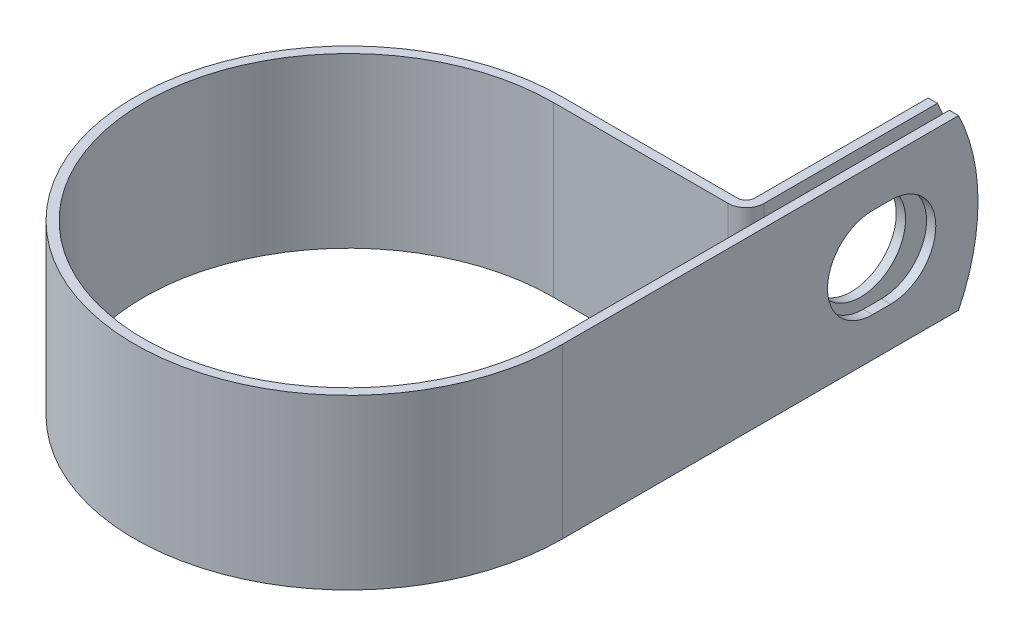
ISO-10303-21;
HEADER;
FILE_DESCRIPTION(('STEP AP214'),'2;1');
FILE_NAME('part.step','',(''),(''),'','','');
FILE_SCHEMA(('AUTOMOTIVE_DESIGN { 1 0 10303 214 1 1 1 1 }'));
ENDSEC;
DATA;
#1=APPLICATION_CONTEXT('core data for automotive mechanical design processes');
#2=APPLICATION_PROTOCOL_DEFINITION('international standard','automotive_design',2000,#1);
#3=PRODUCT_CONTEXT('',#1,'mechanical');
#4=PRODUCT('Part','Part','',(#3));
#5=PRODUCT_RELATED_PRODUCT_CATEGORY('part','',(#4));
#6=PRODUCT_DEFINITION_FORMATION('','',#4);
#7=PRODUCT_DEFINITION_CONTEXT('part definition',#1,'design');
#8=PRODUCT_DEFINITION('design','',#6,#7);
#9=PRODUCT_DEFINITION_SHAPE('','',#8);
#10=(LENGTH_UNIT() NAMED_UNIT(*) SI_UNIT(.MILLI.,.METRE.));
#11=(NAMED_UNIT(*) PLANE_ANGLE_UNIT() SI_UNIT($,.RADIAN.));
#12=(NAMED_UNIT(*) SI_UNIT($,.STERADIAN.) SOLID_ANGLE_UNIT());
#13=UNCERTAINTY_MEASURE_WITH_UNIT(LENGTH_MEASURE(1.E-05),#10,'distance_accuracy_value','');
#14=(GEOMETRIC_REPRESENTATION_CONTEXT(3) GLOBAL_UNCERTAINTY_ASSIGNED_CONTEXT((#13)) GLOBAL_UNIT_ASSIGNED_CONTEXT((#10,
#11,#12)) REPRESENTATION_CONTEXT('',''));
#15=CARTESIAN_POINT('',(0.,0.,0.));
#16=DIRECTION('',(0.,0.,1.));
#17=DIRECTION('',(1.,0.,0.));
#18=AXIS2_PLACEMENT_3D('',#15,#16,#17);
#19=CARTESIAN_POINT('',(26.9875,11.1125,0.));
#20=DIRECTION('',(-1.,0.,0.));
#21=DIRECTION('',(0.,0.,1.));
#22=AXIS2_PLACEMENT_3D('',#19,#20,#21);
#23=PLANE('',#22);
#24=DIRECTION('',(0.,0.,-1.));
#25=VECTOR('',#24,1.);
#26=CARTESIAN_POINT('',(26.9875,-5.9436,-40.8685999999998));
#27=LINE('',#26,#25);
#28=CARTESIAN_POINT('',(26.9875,-5.9436,-40.8685999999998));
#29=VERTEX_POINT('',#28);
#30=CARTESIAN_POINT('',(26.9875,-5.9436,-43.2562000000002));
#31=VERTEX_POINT('',#30);
#32=EDGE_CURVE('E218',#29,#31,#27,.T.);
#33=ORIENTED_EDGE('',*,*,#32,.T.);
#34=CARTESIAN_POINT('',(26.9875,0.,-43.2561999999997));
#35=DIRECTION('',(-1.,0.,0.));
#36=DIRECTION('',(0.,0.,1.));
#37=AXIS2_PLACEMENT_3D('',#34,#35,#36);
#38=CIRCLE('',#37,5.9436);
#39=CARTESIAN_POINT('',(26.9875,5.9436,-43.2562000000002));
#40=VERTEX_POINT('',#39);
#41=EDGE_CURVE('E239',#31,#40,#38,.F.);
#42=ORIENTED_EDGE('',*,*,#41,.T.);
#43=DIRECTION('',(0.,0.,1.));
#44=VECTOR('',#43,1.);
#45=CARTESIAN_POINT('',(26.9875,5.9436,-40.8685999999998));
#46=LINE('',#45,#44);
#47=CARTESIAN_POINT('',(26.9875,5.9436,-40.8685999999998));
#48=VERTEX_POINT('',#47);
#49=EDGE_CURVE('E235',#40,#48,#46,.T.);
#50=ORIENTED_EDGE('',*,*,#49,.T.);
#51=CARTESIAN_POINT('',(26.9875,0.,-40.8685999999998));
#52=DIRECTION('',(-1.,0.,0.));
#53=DIRECTION('',(0.,0.,1.));
#54=AXIS2_PLACEMENT_3D('',#51,#52,#53);
#55=CIRCLE('',#54,5.9436);
#56=EDGE_CURVE('E230',#48,#29,#55,.F.);
#57=ORIENTED_EDGE('',*,*,#56,.T.);
#58=EDGE_LOOP('',(#33,#42,#50,#57));
#59=FACE_BOUND('',#58,.T.);
#60=CARTESIAN_POINT('',(26.9875,0.,-29.3624));
#61=DIRECTION('',(-1.,0.,0.));
#62=DIRECTION('',(0.,0.,1.));
#63=AXIS2_PLACEMENT_3D('',#60,#61,#62);
#64=CIRCLE('',#63,25.4);
#65=CARTESIAN_POINT('',(26.9875,11.1125,-52.2025476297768));
#66=VERTEX_POINT('',#65);
#67=CARTESIAN_POINT('',(26.9875,-11.1125,-52.2025476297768));
#68=VERTEX_POINT('',#67);
#69=EDGE_CURVE('E57',#66,#68,#64,.T.);
#70=ORIENTED_EDGE('',*,*,#69,.T.);
#71=DIRECTION('',(0.,0.,-1.));
#72=VECTOR('',#71,1.);
#73=CARTESIAN_POINT('',(26.9875,-11.1125,0.));
#74=LINE('',#73,#72);
#75=CARTESIAN_POINT('',(26.9875,-11.1125,0.));
#76=VERTEX_POINT('',#75);
#77=EDGE_CURVE('E253',#76,#68,#74,.T.);
#78=ORIENTED_EDGE('',*,*,#77,.F.);
#79=DIRECTION('',(0.,-1.,0.));
#80=VECTOR('',#79,1.);
#81=CARTESIAN_POINT('',(26.9875,11.1125,0.));
#82=LINE('',#81,#80);
#83=CARTESIAN_POINT('',(26.9875,11.1125,0.));
#84=VERTEX_POINT('',#83);
#85=EDGE_CURVE('E200',#84,#76,#82,.T.);
#86=ORIENTED_EDGE('',*,*,#85,.F.);
#87=DIRECTION('',(0.,0.,-1.));
#88=VECTOR('',#87,1.);
#89=CARTESIAN_POINT('',(26.9875,11.1125,-26.9875));
#90=LINE('',#89,#88);
#91=EDGE_CURVE('E255',#84,#66,#90,.T.);
#92=ORIENTED_EDGE('',*,*,#91,.T.);
#93=EDGE_LOOP('',(#70,#78,#86,#92));
#94=FACE_BOUND('',#93,.T.);
#95=ADVANCED_FACE('F36',(#59,#94),#23,.T.);
#96=CARTESIAN_POINT('',(25.4127,11.1125,-54.7624));
#97=DIRECTION('',(1.,0.,0.));
#98=DIRECTION('',(0.,0.,-1.));
#99=AXIS2_PLACEMENT_3D('',#96,#97,#98);
#100=PLANE('',#99);
#101=CARTESIAN_POINT('',(25.4127,0.,-42.0624));
#102=DIRECTION('',(1.,0.,0.));
#103=DIRECTION('',(0.,0.,-1.));
#104=AXIS2_PLACEMENT_3D('',#101,#102,#103);
#105=CIRCLE('',#104,5.9436);
#106=CARTESIAN_POINT('',(25.4127,0.,-48.006));
#107=VERTEX_POINT('',#106);
#108=EDGE_CURVE('E250',#107,#107,#105,.F.);
#109=ORIENTED_EDGE('',*,*,#108,.T.);
#110=EDGE_LOOP('',(#109));
#111=FACE_BOUND('',#110,.T.);
#112=DIRECTION('',(0.,0.,1.));
#113=VECTOR('',#112,1.);
#114=CARTESIAN_POINT('',(25.4127,-11.1125,-54.7624));
#115=LINE('',#114,#113);
#116=CARTESIAN_POINT('',(25.4127,-11.1125,-52.2025476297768));
#117=VERTEX_POINT('',#116);
#118=CARTESIAN_POINT('',(25.4127,-11.1125,-29.36494));
#119=VERTEX_POINT('',#118);
#120=EDGE_CURVE('E166',#117,#119,#115,.T.);
#121=ORIENTED_EDGE('',*,*,#120,.F.);
#122=CARTESIAN_POINT('',(25.4127,0.,-29.3624));
#123=DIRECTION('',(1.,0.,0.));
#124=DIRECTION('',(0.,0.,-1.));
#125=AXIS2_PLACEMENT_3D('',#122,#123,#124);
#126=CIRCLE('',#125,25.4);
#127=CARTESIAN_POINT('',(25.4127,11.1125,-52.2025476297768));
#128=VERTEX_POINT('',#127);
#129=EDGE_CURVE('E158',#117,#128,#126,.T.);
#130=ORIENTED_EDGE('',*,*,#129,.T.);
#131=DIRECTION('',(0.,0.,1.));
#132=VECTOR('',#131,1.);
#133=CARTESIAN_POINT('',(25.4127,11.1125,-54.7624));
#134=LINE('',#133,#132);
#135=CARTESIAN_POINT('',(25.4127,11.1125,-29.36494));
#136=VERTEX_POINT('',#135);
#137=EDGE_CURVE('E206',#128,#136,#134,.T.);
#138=ORIENTED_EDGE('',*,*,#137,.T.);
#139=DIRECTION('',(0.,-1.,0.));
#140=VECTOR('',#139,1.);
#141=CARTESIAN_POINT('',(25.4127,11.1125,-29.36494));
#142=LINE('',#141,#140);
#143=EDGE_CURVE('E193',#136,#119,#142,.T.);
#144=ORIENTED_EDGE('',*,*,#143,.T.);
#145=EDGE_LOOP('',(#121,#130,#138,#144));
#146=FACE_BOUND('',#145,.T.);
#147=ADVANCED_FACE('F208',(#111,#146),#100,.T.);
#148=CARTESIAN_POINT('',(24.1935,11.1125,-54.7624));
#149=DIRECTION('',(1.,0.,0.));
#150=DIRECTION('',(0.,0.,-1.));
#151=AXIS2_PLACEMENT_3D('',#148,#149,#150);
#152=PLANE('',#151);
#153=CARTESIAN_POINT('',(24.1935,0.,-42.0624));
#154=DIRECTION('',(-1.,0.,0.));
#155=DIRECTION('',(0.,0.,1.));
#156=AXIS2_PLACEMENT_3D('',#153,#154,#155);
#157=CIRCLE('',#156,5.9436);
#158=CARTESIAN_POINT('',(24.1935,0.,-36.1188));
#159=VERTEX_POINT('',#158);
#160=EDGE_CURVE('E247',#159,#159,#157,.T.);
#161=ORIENTED_EDGE('',*,*,#160,.F.);
#162=EDGE_LOOP('',(#161));
#163=FACE_BOUND('',#162,.T.);
#164=CARTESIAN_POINT('',(24.1935,0.,-29.3624));
#165=DIRECTION('',(-1.,0.,0.));
#166=DIRECTION('',(0.,0.,1.));
#167=AXIS2_PLACEMENT_3D('',#164,#165,#166);
#168=CIRCLE('',#167,25.4);
#169=CARTESIAN_POINT('',(24.1935,11.1125,-52.2025476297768));
#170=VERTEX_POINT('',#169);
#171=CARTESIAN_POINT('',(24.1935,-11.1125,-52.2025476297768));
#172=VERTEX_POINT('',#171);
#173=EDGE_CURVE('E49',#170,#172,#168,.T.);
#174=ORIENTED_EDGE('',*,*,#173,.T.);
#175=DIRECTION('',(0.,0.,1.));
#176=VECTOR('',#175,1.);
#177=CARTESIAN_POINT('',(24.1935,-11.1125,-54.7624));
#178=LINE('',#177,#176);
#179=CARTESIAN_POINT('',(24.1935,-11.1125,-29.36494));
#180=VERTEX_POINT('',#179);
#181=EDGE_CURVE('E149',#172,#180,#178,.T.);
#182=ORIENTED_EDGE('',*,*,#181,.T.);
#183=DIRECTION('',(0.,-1.,0.));
#184=VECTOR('',#183,1.);
#185=CARTESIAN_POINT('',(24.1935,11.1125,-29.36494));
#186=LINE('',#185,#184);
#187=CARTESIAN_POINT('',(24.1935,11.1125,-29.36494));
#188=VERTEX_POINT('',#187);
#189=EDGE_CURVE('E191',#188,#180,#186,.T.);
#190=ORIENTED_EDGE('',*,*,#189,.F.);
#191=DIRECTION('',(0.,0.,1.));
#192=VECTOR('',#191,1.);
#193=CARTESIAN_POINT('',(24.1935,11.1125,-54.7624));
#194=LINE('',#193,#192);
#195=EDGE_CURVE('E151',#170,#188,#194,.T.);
#196=ORIENTED_EDGE('',*,*,#195,.F.);
#197=EDGE_LOOP('',(#174,#182,#190,#196));
#198=FACE_BOUND('',#197,.T.);
#199=ADVANCED_FACE('F146',(#163,#198),#152,.F.);
#200=CARTESIAN_POINT('',(28.2067,11.1125,0.));
#201=DIRECTION('',(-1.,0.,0.));
#202=DIRECTION('',(0.,0.,1.));
#203=AXIS2_PLACEMENT_3D('',#200,#201,#202);
#204=PLANE('',#203);
#205=CARTESIAN_POINT('',(28.2067,0.,-43.2561999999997));
#206=DIRECTION('',(1.,0.,0.));
#207=DIRECTION('',(0.,0.,-1.));
#208=AXIS2_PLACEMENT_3D('',#205,#206,#207);
#209=CIRCLE('',#208,5.9436);
#210=CARTESIAN_POINT('',(28.2067,-5.9436,-43.2562000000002));
#211=VERTEX_POINT('',#210);
#212=CARTESIAN_POINT('',(28.2067,5.9436,-43.2562000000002));
#213=VERTEX_POINT('',#212);
#214=EDGE_CURVE('E219',#211,#213,#209,.T.);
#215=ORIENTED_EDGE('',*,*,#214,.F.);
#216=DIRECTION('',(0.,0.,-1.));
#217=VECTOR('',#216,1.);
#218=CARTESIAN_POINT('',(28.2067,-5.9436,-40.8685999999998));
#219=LINE('',#218,#217);
#220=CARTESIAN_POINT('',(28.2067,-5.9436,-40.8685999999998));
#221=VERTEX_POINT('',#220);
#222=EDGE_CURVE('E222',#221,#211,#219,.T.);
#223=ORIENTED_EDGE('',*,*,#222,.F.);
#224=CARTESIAN_POINT('',(28.2067,0.,-40.8685999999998));
#225=DIRECTION('',(1.,0.,0.));
#226=DIRECTION('',(0.,0.,-1.));
#227=AXIS2_PLACEMENT_3D('',#224,#225,#226);
#228=CIRCLE('',#227,5.9436);
#229=CARTESIAN_POINT('',(28.2067,5.9436,-40.8685999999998));
#230=VERTEX_POINT('',#229);
#231=EDGE_CURVE('E212',#230,#221,#228,.T.);
#232=ORIENTED_EDGE('',*,*,#231,.F.);
#233=DIRECTION('',(0.,0.,1.));
#234=VECTOR('',#233,1.);
#235=CARTESIAN_POINT('',(28.2067,5.9436,-40.8685999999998));
#236=LINE('',#235,#234);
#237=EDGE_CURVE('E216',#213,#230,#236,.T.);
#238=ORIENTED_EDGE('',*,*,#237,.F.);
#239=EDGE_LOOP('',(#215,#223,#232,#238));
#240=FACE_BOUND('',#239,.T.);
#241=DIRECTION('',(0.,0.,-1.));
#242=VECTOR('',#241,1.);
#243=CARTESIAN_POINT('',(28.2067,-11.1125,0.));
#244=LINE('',#243,#242);
#245=CARTESIAN_POINT('',(28.2067,-11.1125,0.));
#246=VERTEX_POINT('',#245);
#247=CARTESIAN_POINT('',(28.2067,-11.1125,-52.2025476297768));
#248=VERTEX_POINT('',#247);
#249=EDGE_CURVE('E177',#246,#248,#244,.T.);
#250=ORIENTED_EDGE('',*,*,#249,.T.);
#251=CARTESIAN_POINT('',(28.2067,0.,-29.3624));
#252=DIRECTION('',(-1.,0.,0.));
#253=DIRECTION('',(0.,0.,1.));
#254=AXIS2_PLACEMENT_3D('',#251,#252,#253);
#255=CIRCLE('',#254,25.4);
#256=CARTESIAN_POINT('',(28.2067,11.1125,-52.2025476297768));
#257=VERTEX_POINT('',#256);
#258=EDGE_CURVE('E152',#257,#248,#255,.T.);
#259=ORIENTED_EDGE('',*,*,#258,.F.);
#260=DIRECTION('',(0.,0.,-1.));
#261=VECTOR('',#260,1.);
#262=CARTESIAN_POINT('',(28.2067,11.1125,-26.9875));
#263=LINE('',#262,#261);
#264=CARTESIAN_POINT('',(28.2067,11.1125,0.));
#265=VERTEX_POINT('',#264);
#266=EDGE_CURVE('E180',#265,#257,#263,.T.);
#267=ORIENTED_EDGE('',*,*,#266,.F.);
#268=DIRECTION('',(0.,-1.,0.));
#269=VECTOR('',#268,1.);
#270=CARTESIAN_POINT('',(28.2067,11.1125,0.));
#271=LINE('',#270,#269);
#272=EDGE_CURVE('E181',#265,#246,#271,.T.);
#273=ORIENTED_EDGE('',*,*,#272,.T.);
#274=EDGE_LOOP('',(#250,#259,#267,#273));
#275=FACE_BOUND('',#274,.T.);
#276=ADVANCED_FACE('F303',(#240,#275),#204,.F.);
#277=CARTESIAN_POINT('',(0.,-11.1125,0.));
#278=DIRECTION('',(0.,1.,0.));
#279=DIRECTION('',(1.,0.,0.));
#280=AXIS2_PLACEMENT_3D('',#277,#278,#279);
#281=PLANE('',#280);
#282=DIRECTION('',(-1.,0.,0.));
#283=VECTOR('',#282,1.);
#284=CARTESIAN_POINT('',(28.2067,-11.1125,-52.2025476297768));
#285=LINE('',#284,#283);
#286=EDGE_CURVE('E153',#248,#68,#285,.T.);
#287=ORIENTED_EDGE('',*,*,#286,.F.);
#288=ORIENTED_EDGE('',*,*,#249,.F.);
#289=CARTESIAN_POINT('',(0.,-11.1125,0.));
#290=DIRECTION('',(0.,1.,0.));
#291=DIRECTION('',(1.,0.,0.));
#292=AXIS2_PLACEMENT_3D('',#289,#290,#291);
#293=CIRCLE('',#292,28.2067);
#294=CARTESIAN_POINT('',(0.,-11.1125,-28.2067));
#295=VERTEX_POINT('',#294);
#296=EDGE_CURVE('E175',#295,#246,#293,.T.);
#297=ORIENTED_EDGE('',*,*,#296,.F.);
#298=DIRECTION('',(1.,0.,0.));
#299=VECTOR('',#298,1.);
#300=CARTESIAN_POINT('',(0.,-11.1125,-28.2067));
#301=LINE('',#300,#299);
#302=CARTESIAN_POINT('',(23.03526,-11.1125,-28.2067));
#303=VERTEX_POINT('',#302);
#304=EDGE_CURVE('E168',#303,#295,#301,.F.);
#305=ORIENTED_EDGE('',*,*,#304,.F.);
#306=CARTESIAN_POINT('',(23.03526,-11.1125,-29.36494));
#307=DIRECTION('',(0.,1.,0.));
#308=DIRECTION('',(1.,0.,0.));
#309=AXIS2_PLACEMENT_3D('',#306,#307,#308);
#310=CIRCLE('',#309,1.15824);
#311=EDGE_CURVE('E165',#180,#303,#310,.F.);
#312=ORIENTED_EDGE('',*,*,#311,.F.);
#313=ORIENTED_EDGE('',*,*,#181,.F.);
#314=DIRECTION('',(-1.,0.,0.));
#315=VECTOR('',#314,1.);
#316=CARTESIAN_POINT('',(28.2067,-11.1125,-52.2025476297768));
#317=LINE('',#316,#315);
#318=EDGE_CURVE('E11',#117,#172,#317,.T.);
#319=ORIENTED_EDGE('',*,*,#318,.F.);
#320=ORIENTED_EDGE('',*,*,#120,.T.);
#321=CARTESIAN_POINT('',(23.03526,-11.1125,-29.36494));
#322=DIRECTION('',(0.,-1.,0.));
#323=DIRECTION('',(0.,0.,1.));
#324=AXIS2_PLACEMENT_3D('',#321,#322,#323);
#325=CIRCLE('',#324,2.37744);
#326=CARTESIAN_POINT('',(23.03526,-11.1125,-26.9875));
#327=VERTEX_POINT('',#326);
#328=EDGE_CURVE('E170',#119,#327,#325,.T.);
#329=ORIENTED_EDGE('',*,*,#328,.T.);
#330=DIRECTION('',(-1.,0.,0.));
#331=VECTOR('',#330,1.);
#332=CARTESIAN_POINT('',(0.,-11.1125,-26.9875));
#333=LINE('',#332,#331);
#334=CARTESIAN_POINT('',(0.,-11.1125,-26.9875));
#335=VERTEX_POINT('',#334);
#336=EDGE_CURVE('E280',#327,#335,#333,.T.);
#337=ORIENTED_EDGE('',*,*,#336,.T.);
#338=CARTESIAN_POINT('',(0.,-11.1125,0.));
#339=DIRECTION('',(0.,1.,0.));
#340=DIRECTION('',(0.,0.,1.));
#341=AXIS2_PLACEMENT_3D('',#338,#339,#340);
#342=CIRCLE('',#341,26.9875);
#343=EDGE_CURVE('E277',#335,#76,#342,.T.);
#344=ORIENTED_EDGE('',*,*,#343,.T.);
#345=ORIENTED_EDGE('',*,*,#77,.T.);
#346=EDGE_LOOP('',(#287,#288,#297,#305,#312,#313,#319,#320,#329,#337,#344,#345));
#347=FACE_BOUND('',#346,.T.);
#348=ADVANCED_FACE('F163',(#347),#281,.F.);
#349=CARTESIAN_POINT('',(0.,11.1125,0.));
#350=DIRECTION('',(0.,1.,0.));
#351=DIRECTION('',(1.,0.,0.));
#352=AXIS2_PLACEMENT_3D('',#349,#350,#351);
#353=PLANE('',#352);
#354=ORIENTED_EDGE('',*,*,#266,.T.);
#355=DIRECTION('',(-1.,0.,0.));
#356=VECTOR('',#355,1.);
#357=CARTESIAN_POINT('',(28.2067,11.1125,-52.2025476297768));
#358=LINE('',#357,#356);
#359=EDGE_CURVE('E210',#257,#66,#358,.T.);
#360=ORIENTED_EDGE('',*,*,#359,.T.);
#361=ORIENTED_EDGE('',*,*,#91,.F.);
#362=CARTESIAN_POINT('',(0.,11.1125,0.));
#363=DIRECTION('',(0.,1.,0.));
#364=DIRECTION('',(0.,0.,1.));
#365=AXIS2_PLACEMENT_3D('',#362,#363,#364);
#366=CIRCLE('',#365,26.9875);
#367=CARTESIAN_POINT('',(0.,11.1125,-26.9875));
#368=VERTEX_POINT('',#367);
#369=EDGE_CURVE('E258',#368,#84,#366,.T.);
#370=ORIENTED_EDGE('',*,*,#369,.F.);
#371=DIRECTION('',(-1.,0.,0.));
#372=VECTOR('',#371,1.);
#373=CARTESIAN_POINT('',(0.,11.1125,-26.9875));
#374=LINE('',#373,#372);
#375=CARTESIAN_POINT('',(23.03526,11.1125,-26.9875));
#376=VERTEX_POINT('',#375);
#377=EDGE_CURVE('E261',#376,#368,#374,.T.);
#378=ORIENTED_EDGE('',*,*,#377,.F.);
#379=CARTESIAN_POINT('',(23.03526,11.1125,-29.36494));
#380=DIRECTION('',(0.,-1.,0.));
#381=DIRECTION('',(0.,0.,1.));
#382=AXIS2_PLACEMENT_3D('',#379,#380,#381);
#383=CIRCLE('',#382,2.37744);
#384=EDGE_CURVE('E264',#136,#376,#383,.T.);
#385=ORIENTED_EDGE('',*,*,#384,.F.);
#386=ORIENTED_EDGE('',*,*,#137,.F.);
#387=DIRECTION('',(-1.,0.,0.));
#388=VECTOR('',#387,1.);
#389=CARTESIAN_POINT('',(28.2067,11.1125,-52.2025476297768));
#390=LINE('',#389,#388);
#391=EDGE_CURVE('E43',#128,#170,#390,.T.);
#392=ORIENTED_EDGE('',*,*,#391,.T.);
#393=ORIENTED_EDGE('',*,*,#195,.T.);
#394=CARTESIAN_POINT('',(23.03526,11.1125,-29.36494));
#395=DIRECTION('',(0.,1.,0.));
#396=DIRECTION('',(1.,0.,0.));
#397=AXIS2_PLACEMENT_3D('',#394,#395,#396);
#398=CIRCLE('',#397,1.15824);
#399=CARTESIAN_POINT('',(23.03526,11.1125,-28.2067));
#400=VERTEX_POINT('',#399);
#401=EDGE_CURVE('E269',#188,#400,#398,.F.);
#402=ORIENTED_EDGE('',*,*,#401,.T.);
#403=DIRECTION('',(1.,0.,0.));
#404=VECTOR('',#403,1.);
#405=CARTESIAN_POINT('',(0.,11.1125,-28.2067));
#406=LINE('',#405,#404);
#407=CARTESIAN_POINT('',(0.,11.1125,-28.2067));
#408=VERTEX_POINT('',#407);
#409=EDGE_CURVE('E271',#400,#408,#406,.F.);
#410=ORIENTED_EDGE('',*,*,#409,.T.);
#411=CARTESIAN_POINT('',(0.,11.1125,0.));
#412=DIRECTION('',(0.,1.,0.));
#413=DIRECTION('',(1.,0.,0.));
#414=AXIS2_PLACEMENT_3D('',#411,#412,#413);
#415=CIRCLE('',#414,28.2067);
#416=EDGE_CURVE('E185',#408,#265,#415,.T.);
#417=ORIENTED_EDGE('',*,*,#416,.T.);
#418=EDGE_LOOP('',(#354,#360,#361,#370,#378,#385,#386,#392,#393,#402,#410,#417));
#419=FACE_BOUND('',#418,.T.);
#420=ADVANCED_FACE('F204',(#419),#353,.T.);
#421=CARTESIAN_POINT('',(0.,11.1125,0.));
#422=DIRECTION('',(0.,-1.,0.));
#423=DIRECTION('',(0.,0.,-1.));
#424=AXIS2_PLACEMENT_3D('',#421,#422,#423);
#425=CYLINDRICAL_SURFACE('',#424,26.9875);
#426=ORIENTED_EDGE('',*,*,#343,.F.);
#427=DIRECTION('',(0.,-1.,0.));
#428=VECTOR('',#427,1.);
#429=CARTESIAN_POINT('',(0.,11.1125,-26.9875));
#430=LINE('',#429,#428);
#431=EDGE_CURVE('E198',#368,#335,#430,.T.);
#432=ORIENTED_EDGE('',*,*,#431,.F.);
#433=ORIENTED_EDGE('',*,*,#369,.T.);
#434=ORIENTED_EDGE('',*,*,#85,.T.);
#435=EDGE_LOOP('',(#426,#432,#433,#434));
#436=FACE_BOUND('',#435,.T.);
#437=ADVANCED_FACE('F293',(#436),#425,.F.);
#438=CARTESIAN_POINT('',(0.,11.1125,-26.9875));
#439=DIRECTION('',(0.,0.,1.));
#440=DIRECTION('',(1.,0.,0.));
#441=AXIS2_PLACEMENT_3D('',#438,#439,#440);
#442=PLANE('',#441);
#443=ORIENTED_EDGE('',*,*,#336,.F.);
#444=DIRECTION('',(0.,-1.,0.));
#445=VECTOR('',#444,1.);
#446=CARTESIAN_POINT('',(23.03526,11.1125,-26.9875));
#447=LINE('',#446,#445);
#448=EDGE_CURVE('E196',#376,#327,#447,.T.);
#449=ORIENTED_EDGE('',*,*,#448,.F.);
#450=ORIENTED_EDGE('',*,*,#377,.T.);
#451=ORIENTED_EDGE('',*,*,#431,.T.);
#452=EDGE_LOOP('',(#443,#449,#450,#451));
#453=FACE_BOUND('',#452,.T.);
#454=ADVANCED_FACE('F289',(#453),#442,.T.);
#455=CARTESIAN_POINT('',(23.03526,11.1125,-29.36494));
#456=DIRECTION('',(0.,-1.,0.));
#457=DIRECTION('',(0.,0.,-1.));
#458=AXIS2_PLACEMENT_3D('',#455,#456,#457);
#459=CYLINDRICAL_SURFACE('',#458,2.37744);
#460=ORIENTED_EDGE('',*,*,#328,.F.);
#461=ORIENTED_EDGE('',*,*,#143,.F.);
#462=ORIENTED_EDGE('',*,*,#384,.T.);
#463=ORIENTED_EDGE('',*,*,#448,.T.);
#464=EDGE_LOOP('',(#460,#461,#462,#463));
#465=FACE_BOUND('',#464,.T.);
#466=ADVANCED_FACE('F286',(#465),#459,.T.);
#467=CARTESIAN_POINT('',(23.03526,11.1125,-29.36494));
#468=DIRECTION('',(0.,-1.,0.));
#469=DIRECTION('',(0.,0.,-1.));
#470=AXIS2_PLACEMENT_3D('',#467,#468,#469);
#471=CYLINDRICAL_SURFACE('',#470,1.15824);
#472=ORIENTED_EDGE('',*,*,#311,.T.);
#473=DIRECTION('',(0.,-1.,0.));
#474=VECTOR('',#473,1.);
#475=CARTESIAN_POINT('',(23.03526,11.1125,-28.2067));
#476=LINE('',#475,#474);
#477=EDGE_CURVE('E188',#400,#303,#476,.T.);
#478=ORIENTED_EDGE('',*,*,#477,.F.);
#479=ORIENTED_EDGE('',*,*,#401,.F.);
#480=ORIENTED_EDGE('',*,*,#189,.T.);
#481=EDGE_LOOP('',(#472,#478,#479,#480));
#482=FACE_BOUND('',#481,.T.);
#483=ADVANCED_FACE('F316',(#482),#471,.F.);
#484=CARTESIAN_POINT('',(0.,11.1125,-28.2067));
#485=DIRECTION('',(0.,0.,1.));
#486=DIRECTION('',(1.,0.,0.));
#487=AXIS2_PLACEMENT_3D('',#484,#485,#486);
#488=PLANE('',#487);
#489=ORIENTED_EDGE('',*,*,#304,.T.);
#490=DIRECTION('',(0.,-1.,0.));
#491=VECTOR('',#490,1.);
#492=CARTESIAN_POINT('',(0.,11.1125,-28.2067));
#493=LINE('',#492,#491);
#494=EDGE_CURVE('E184',#408,#295,#493,.T.);
#495=ORIENTED_EDGE('',*,*,#494,.F.);
#496=ORIENTED_EDGE('',*,*,#409,.F.);
#497=ORIENTED_EDGE('',*,*,#477,.T.);
#498=EDGE_LOOP('',(#489,#495,#496,#497));
#499=FACE_BOUND('',#498,.T.);
#500=ADVANCED_FACE('F312',(#499),#488,.F.);
#501=CARTESIAN_POINT('',(0.,11.1125,0.));
#502=DIRECTION('',(0.,-1.,0.));
#503=DIRECTION('',(0.,0.,-1.));
#504=AXIS2_PLACEMENT_3D('',#501,#502,#503);
#505=CYLINDRICAL_SURFACE('',#504,28.2067);
#506=ORIENTED_EDGE('',*,*,#296,.T.);
#507=ORIENTED_EDGE('',*,*,#272,.F.);
#508=ORIENTED_EDGE('',*,*,#416,.F.);
#509=ORIENTED_EDGE('',*,*,#494,.T.);
#510=EDGE_LOOP('',(#506,#507,#508,#509));
#511=FACE_BOUND('',#510,.T.);
#512=ADVANCED_FACE('F309',(#511),#505,.T.);
#513=CARTESIAN_POINT('',(42.2237394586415,0.,-42.0624));
#514=DIRECTION('',(-1.,0.,0.));
#515=DIRECTION('',(0.,0.,1.));
#516=AXIS2_PLACEMENT_3D('',#513,#514,#515);
#517=CYLINDRICAL_SURFACE('',#516,5.9436);
#518=ORIENTED_EDGE('',*,*,#160,.T.);
#519=EDGE_LOOP('',(#518));
#520=FACE_BOUND('',#519,.T.);
#521=ORIENTED_EDGE('',*,*,#108,.F.);
#522=EDGE_LOOP('',(#521));
#523=FACE_BOUND('',#522,.T.);
#524=ADVANCED_FACE('F361',(#520,#523),#517,.F.);
#525=CARTESIAN_POINT('',(8.41129374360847,-5.9436,-40.8685999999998));
#526=DIRECTION('',(0.,-1.,0.));
#527=DIRECTION('',(0.,0.,-1.));
#528=AXIS2_PLACEMENT_3D('',#525,#526,#527);
#529=PLANE('',#528);
#530=DIRECTION('',(1.,0.,0.));
#531=VECTOR('',#530,1.);
#532=CARTESIAN_POINT('',(8.41129374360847,-5.9436,-40.8685999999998));
#533=LINE('',#532,#531);
#534=EDGE_CURVE('E233',#29,#221,#533,.T.);
#535=ORIENTED_EDGE('',*,*,#534,.T.);
#536=ORIENTED_EDGE('',*,*,#222,.T.);
#537=DIRECTION('',(1.,0.,0.));
#538=VECTOR('',#537,1.);
#539=CARTESIAN_POINT('',(8.41129374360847,-5.9436,-43.2562000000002));
#540=LINE('',#539,#538);
#541=EDGE_CURVE('E229',#31,#211,#540,.T.);
#542=ORIENTED_EDGE('',*,*,#541,.F.);
#543=ORIENTED_EDGE('',*,*,#32,.F.);
#544=EDGE_LOOP('',(#535,#536,#542,#543));
#545=FACE_BOUND('',#544,.T.);
#546=ADVANCED_FACE('F336',(#545),#529,.F.);
#547=CARTESIAN_POINT('',(8.41129374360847,0.,-43.2561999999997));
#548=DIRECTION('',(1.,0.,0.));
#549=DIRECTION('',(0.,0.,-1.));
#550=AXIS2_PLACEMENT_3D('',#547,#548,#549);
#551=CYLINDRICAL_SURFACE('',#550,5.9436);
#552=ORIENTED_EDGE('',*,*,#541,.T.);
#553=ORIENTED_EDGE('',*,*,#214,.T.);
#554=DIRECTION('',(1.,0.,0.));
#555=VECTOR('',#554,1.);
#556=CARTESIAN_POINT('',(8.41129374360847,5.9436,-43.2562000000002));
#557=LINE('',#556,#555);
#558=EDGE_CURVE('E238',#40,#213,#557,.T.);
#559=ORIENTED_EDGE('',*,*,#558,.F.);
#560=ORIENTED_EDGE('',*,*,#41,.F.);
#561=EDGE_LOOP('',(#552,#553,#559,#560));
#562=FACE_BOUND('',#561,.T.);
#563=ADVANCED_FACE('F340',(#562),#551,.F.);
#564=CARTESIAN_POINT('',(8.41129374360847,5.9436,-40.8685999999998));
#565=DIRECTION('',(0.,1.,0.));
#566=DIRECTION('',(0.,0.,1.));
#567=AXIS2_PLACEMENT_3D('',#564,#565,#566);
#568=PLANE('',#567);
#569=ORIENTED_EDGE('',*,*,#558,.T.);
#570=ORIENTED_EDGE('',*,*,#237,.T.);
#571=DIRECTION('',(1.,0.,0.));
#572=VECTOR('',#571,1.);
#573=CARTESIAN_POINT('',(8.41129374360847,5.9436,-40.8685999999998));
#574=LINE('',#573,#572);
#575=EDGE_CURVE('E234',#48,#230,#574,.T.);
#576=ORIENTED_EDGE('',*,*,#575,.F.);
#577=ORIENTED_EDGE('',*,*,#49,.F.);
#578=EDGE_LOOP('',(#569,#570,#576,#577));
#579=FACE_BOUND('',#578,.T.);
#580=ADVANCED_FACE('F344',(#579),#568,.F.);
#581=CARTESIAN_POINT('',(8.41129374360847,0.,-40.8685999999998));
#582=DIRECTION('',(1.,0.,0.));
#583=DIRECTION('',(0.,0.,-1.));
#584=AXIS2_PLACEMENT_3D('',#581,#582,#583);
#585=CYLINDRICAL_SURFACE('',#584,5.9436);
#586=ORIENTED_EDGE('',*,*,#575,.T.);
#587=ORIENTED_EDGE('',*,*,#231,.T.);
#588=ORIENTED_EDGE('',*,*,#534,.F.);
#589=ORIENTED_EDGE('',*,*,#56,.F.);
#590=EDGE_LOOP('',(#586,#587,#588,#589));
#591=FACE_BOUND('',#590,.T.);
#592=ADVANCED_FACE('F348',(#591),#585,.F.);
#593=CARTESIAN_POINT('',(28.2067,0.,-29.3624));
#594=DIRECTION('',(-1.,0.,0.));
#595=DIRECTION('',(0.,0.,1.));
#596=AXIS2_PLACEMENT_3D('',#593,#594,#595);
#597=CYLINDRICAL_SURFACE('',#596,25.4);
#598=ORIENTED_EDGE('',*,*,#129,.F.);
#599=ORIENTED_EDGE('',*,*,#318,.T.);
#600=ORIENTED_EDGE('',*,*,#173,.F.);
#601=ORIENTED_EDGE('',*,*,#391,.F.);
#602=EDGE_LOOP('',(#598,#599,#600,#601));
#603=FACE_BOUND('',#602,.T.);
#604=ADVANCED_FACE('F156',(#603),#597,.T.);
#605=ORIENTED_EDGE('',*,*,#359,.F.);
#606=ORIENTED_EDGE('',*,*,#258,.T.);
#607=ORIENTED_EDGE('',*,*,#286,.T.);
#608=ORIENTED_EDGE('',*,*,#69,.F.);
#609=EDGE_LOOP('',(#605,#606,#607,#608));
#610=FACE_BOUND('',#609,.T.);
#611=ADVANCED_FACE('F298',(#610),#597,.T.);
#612=CLOSED_SHELL('',(#95,#147,#199,#276,#348,#420,#437,#454,#466,#483,#500,#512,#524,#546,#563,
#580,#592,#604,#611));
#613=MANIFOLD_SOLID_BREP('B2',#612);
#614=ADVANCED_BREP_SHAPE_REPRESENTATION('',(#18,#613),#14);
#615=SHAPE_DEFINITION_REPRESENTATION(#9,#614);
ENDSEC;
END-ISO-10303-21;
